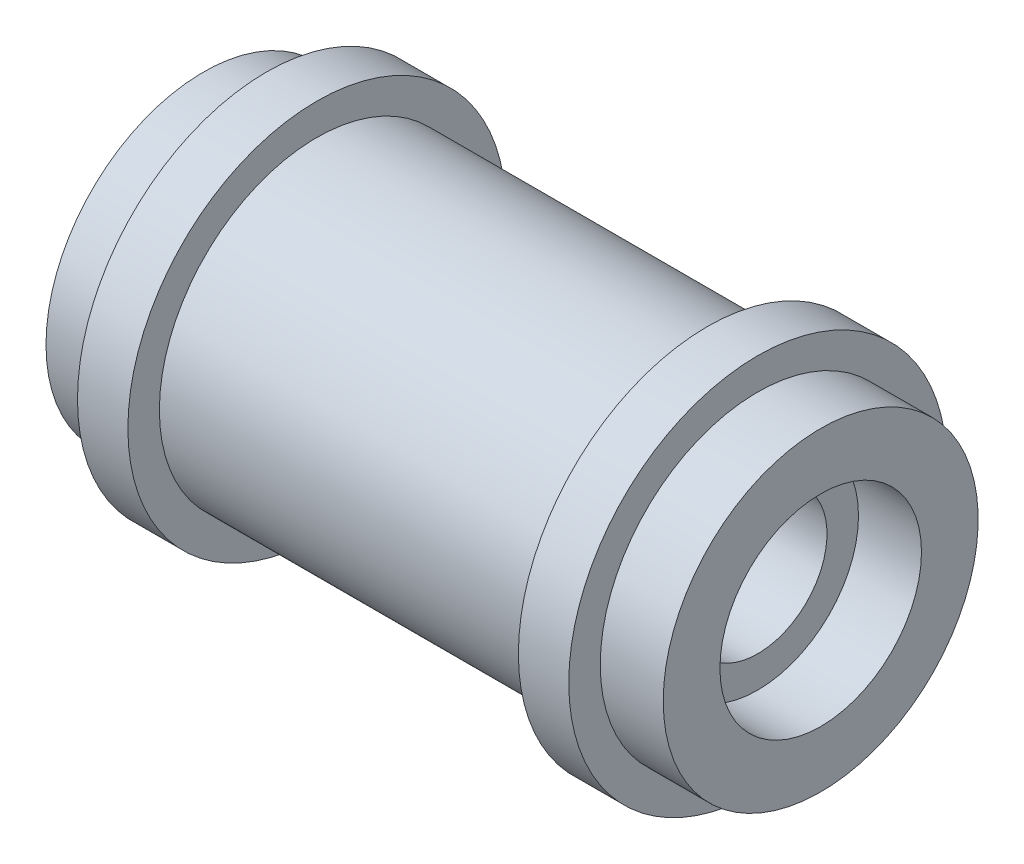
from build123d import *


with BuildPart() as part:
    # Esquisse1 → R_volution1 (revolve)
    with BuildSketch(Plane.XY, mode=Mode.PRIVATE) as r_volution1_sk:
        Polygon((-49, 16), (-39, 16), (-39, 11), (39, 11), (39, 16), (49, 16), (49, 25), (39, 25), (39, 30), (31, 30), (31, 25), (-31, 25), (-31, 30), (-39, 30), (-39, 25), (-49, 25), align=None)
    revolve(r_volution1_sk.sketch.rotate(Axis((-49, 0, 0), (1, 0, 0)), 90), axis=Axis((-49, 0, 0), (1, 0, 0)))


solid = part.part
